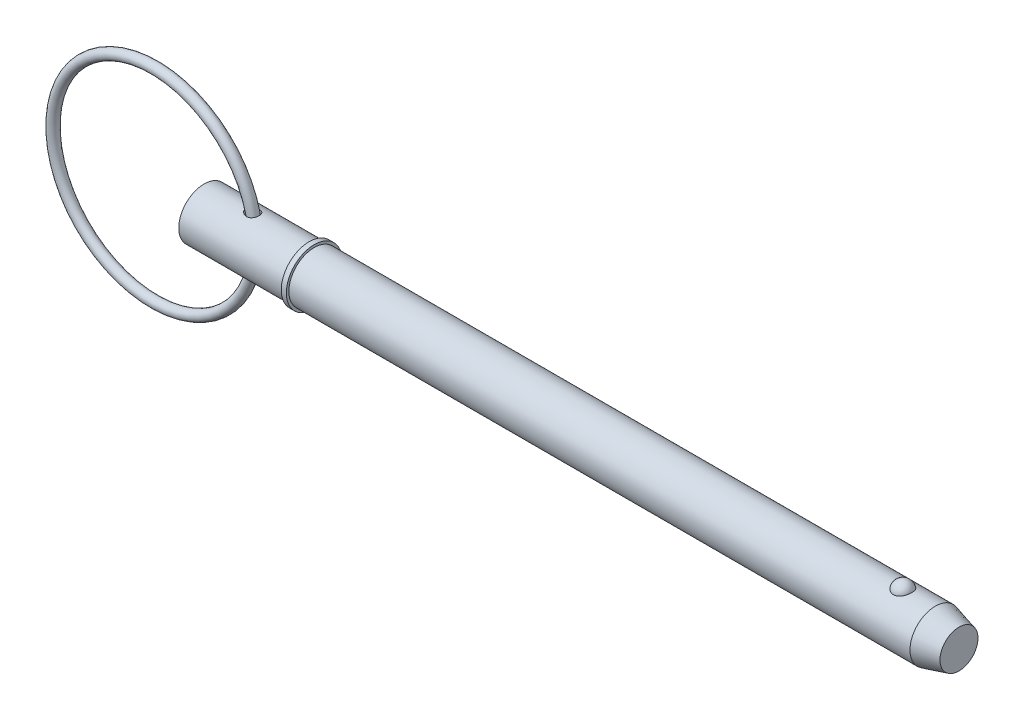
ISO-10303-21;
HEADER;
FILE_DESCRIPTION(('STEP AP214'),'2;1');
FILE_NAME('part.step','',(''),(''),'','','');
FILE_SCHEMA(('AUTOMOTIVE_DESIGN { 1 0 10303 214 1 1 1 1 }'));
ENDSEC;
DATA;
#1=APPLICATION_CONTEXT('core data for automotive mechanical design processes');
#2=APPLICATION_PROTOCOL_DEFINITION('international standard','automotive_design',2000,#1);
#3=PRODUCT_CONTEXT('',#1,'mechanical');
#4=PRODUCT('Part','Part','',(#3));
#5=PRODUCT_RELATED_PRODUCT_CATEGORY('part','',(#4));
#6=PRODUCT_DEFINITION_FORMATION('','',#4);
#7=PRODUCT_DEFINITION_CONTEXT('part definition',#1,'design');
#8=PRODUCT_DEFINITION('design','',#6,#7);
#9=PRODUCT_DEFINITION_SHAPE('','',#8);
#10=(LENGTH_UNIT() NAMED_UNIT(*) SI_UNIT(.MILLI.,.METRE.));
#11=(NAMED_UNIT(*) PLANE_ANGLE_UNIT() SI_UNIT($,.RADIAN.));
#12=(NAMED_UNIT(*) SI_UNIT($,.STERADIAN.) SOLID_ANGLE_UNIT());
#13=UNCERTAINTY_MEASURE_WITH_UNIT(LENGTH_MEASURE(1.E-05),#10,'distance_accuracy_value','');
#14=(GEOMETRIC_REPRESENTATION_CONTEXT(3) GLOBAL_UNCERTAINTY_ASSIGNED_CONTEXT((#13)) GLOBAL_UNIT_ASSIGNED_CONTEXT((#10,
#11,#12)) REPRESENTATION_CONTEXT('',''));
#15=CARTESIAN_POINT('',(0.,0.,0.));
#16=DIRECTION('',(0.,0.,1.));
#17=DIRECTION('',(1.,0.,0.));
#18=AXIS2_PLACEMENT_3D('',#15,#16,#17);
#19=CARTESIAN_POINT('',(-10.8860601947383,0.,0.));
#20=DIRECTION('',(0.,0.,1.));
#21=DIRECTION('',(1.,0.,0.));
#22=AXIS2_PLACEMENT_3D('',#19,#20,#21);
#23=TOROIDAL_SURFACE('',#22,22.225,1.111);
#24=CARTESIAN_POINT('',(12.4499398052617,0.,0.));
#25=VERTEX_POINT('',#24);
#26=VERTEX_LOOP('',#25);
#27=FACE_BOUND('',#26,.T.);
#28=ADVANCED_FACE('P0_F12',(#27),#23,.T.);
#29=CLOSED_SHELL('',(#28));
#30=MANIFOLD_SOLID_BREP('P0_B1',#29);
#31=CARTESIAN_POINT('',(0.,0.,0.));
#32=DIRECTION('',(1.,0.,0.));
#33=DIRECTION('',(0.,0.,-1.));
#34=AXIS2_PLACEMENT_3D('',#31,#32,#33);
#35=CYLINDRICAL_SURFACE('',#34,5.555);
#36=CARTESIAN_POINT('',(9.73108588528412,5.4531967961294,-1.05861687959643));
#37=CARTESIAN_POINT('',(9.79852417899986,5.4428857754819,-1.11173367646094));
#38=CARTESIAN_POINT('',(9.8705426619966,5.43287373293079,-1.15917228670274));
#39=CARTESIAN_POINT('',(10.0216706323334,5.41463354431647,-1.24159548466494));
#40=CARTESIAN_POINT('',(10.100788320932,5.40640749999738,-1.27656543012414));
#41=CARTESIAN_POINT('',(10.2640671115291,5.39277501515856,-1.33298568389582));
#42=CARTESIAN_POINT('',(10.3482338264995,5.38737178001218,-1.35442062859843));
#43=CARTESIAN_POINT('',(10.5191189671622,5.38018930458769,-1.38268153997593));
#44=CARTESIAN_POINT('',(10.6058357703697,5.37840780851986,-1.38951660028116));
#45=CARTESIAN_POINT('',(10.7759121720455,5.37883071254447,-1.38787777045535));
#46=CARTESIAN_POINT('',(10.8592768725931,5.38088957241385,-1.37996287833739));
#47=CARTESIAN_POINT('',(11.0231742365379,5.38856355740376,-1.34968531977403));
#48=CARTESIAN_POINT('',(11.1037078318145,5.39417750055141,-1.3273274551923));
#49=CARTESIAN_POINT('',(11.2542656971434,5.40784427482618,-1.27044672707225));
#50=CARTESIAN_POINT('',(11.3246325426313,5.41571997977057,-1.23678468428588));
#51=CARTESIAN_POINT('',(11.4584043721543,5.43310849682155,-1.15800564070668));
#52=CARTESIAN_POINT('',(11.5218100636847,5.44262114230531,-1.11288980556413));
#53=CARTESIAN_POINT('',(11.6387006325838,5.4619946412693,-1.01348173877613));
#54=CARTESIAN_POINT('',(11.6923567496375,5.47184490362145,-0.959388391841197));
#55=CARTESIAN_POINT('',(11.7899079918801,5.49098914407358,-0.842935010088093));
#56=CARTESIAN_POINT('',(11.8338027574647,5.5002831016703,-0.780574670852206));
#57=CARTESIAN_POINT('',(11.9111930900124,5.51740919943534,-0.648605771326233));
#58=CARTESIAN_POINT('',(11.944571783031,5.52522454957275,-0.578926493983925));
#59=CARTESIAN_POINT('',(11.9994972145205,5.5384271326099,-0.434834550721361));
#60=CARTESIAN_POINT('',(12.0210434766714,5.54381426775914,-0.360421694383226));
#61=CARTESIAN_POINT('',(12.0519313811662,5.55161917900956,-0.208311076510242));
#62=CARTESIAN_POINT('',(12.0611710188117,5.55401212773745,-0.130591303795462));
#63=CARTESIAN_POINT('',(12.0668974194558,5.55548938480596,0.025348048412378));
#64=CARTESIAN_POINT('',(12.0633840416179,5.55457365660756,0.103567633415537));
#65=CARTESIAN_POINT('',(12.0436796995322,5.54953010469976,0.258343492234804));
#66=CARTESIAN_POINT('',(12.0274798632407,5.54540003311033,0.334898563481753));
#67=CARTESIAN_POINT('',(11.9827711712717,5.53437033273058,0.484118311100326));
#68=CARTESIAN_POINT('',(11.9542620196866,5.52747063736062,0.556782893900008));
#69=CARTESIAN_POINT('',(11.8856108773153,5.51165296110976,0.696153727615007));
#70=CARTESIAN_POINT('',(11.8454690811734,5.50273501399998,0.762860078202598));
#71=CARTESIAN_POINT('',(11.7545317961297,5.48386724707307,0.888403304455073));
#72=CARTESIAN_POINT('',(11.7037367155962,5.47391746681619,0.94724048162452));
#73=CARTESIAN_POINT('',(11.5931044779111,5.45416351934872,1.05504470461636));
#74=CARTESIAN_POINT('',(11.533318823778,5.44435885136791,1.10406448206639));
#75=CARTESIAN_POINT('',(11.4061321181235,5.42595363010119,1.19123649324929));
#76=CARTESIAN_POINT('',(11.3387321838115,5.41735290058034,1.22939031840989));
#77=CARTESIAN_POINT('',(11.1991395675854,5.4024225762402,1.29341737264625));
#78=CARTESIAN_POINT('',(11.1270175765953,5.3960658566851,1.3194385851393));
#79=CARTESIAN_POINT('',(10.979323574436,5.38614405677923,1.35937634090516));
#80=CARTESIAN_POINT('',(10.9037515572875,5.38257898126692,1.37329286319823));
#81=CARTESIAN_POINT('',(10.7507722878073,5.37854282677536,1.38901730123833));
#82=CARTESIAN_POINT('',(10.6733560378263,5.37809300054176,1.39074204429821));
#83=CARTESIAN_POINT('',(10.5192388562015,5.38029043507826,1.38221411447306));
#84=CARTESIAN_POINT('',(10.4425381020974,5.38293844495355,1.37195854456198));
#85=CARTESIAN_POINT('',(10.2878936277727,5.39116673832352,1.33926960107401));
#86=CARTESIAN_POINT('',(10.2100819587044,5.3968880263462,1.31624874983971));
#87=CARTESIAN_POINT('',(10.0591420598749,5.4106466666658,1.25849276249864));
#88=CARTESIAN_POINT('',(9.98601576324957,5.41868496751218,1.22375282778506));
#89=CARTESIAN_POINT('',(9.84175565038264,5.43675805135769,1.14087469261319));
#90=CARTESIAN_POINT('',(9.77103801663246,5.44688674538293,1.09202994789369));
#91=CARTESIAN_POINT('',(9.63888287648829,5.46759592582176,0.983100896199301));
#92=CARTESIAN_POINT('',(9.57744762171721,5.47817652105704,0.923013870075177));
#93=CARTESIAN_POINT('',(9.4662044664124,5.49850106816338,0.792984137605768));
#94=CARTESIAN_POINT('',(9.4163677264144,5.5082470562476,0.723066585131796));
#95=CARTESIAN_POINT('',(9.33050546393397,5.52566389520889,0.574973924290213));
#96=CARTESIAN_POINT('',(9.29446727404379,5.53333664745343,0.496806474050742));
#97=CARTESIAN_POINT('',(9.24109888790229,5.54491199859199,0.342579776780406));
#98=CARTESIAN_POINT('',(9.22228936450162,5.54910883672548,0.26705568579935));
#99=CARTESIAN_POINT('',(9.19883437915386,5.55436306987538,0.113748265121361));
#100=CARTESIAN_POINT('',(9.19417820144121,5.55542284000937,0.0359666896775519));
#101=CARTESIAN_POINT('',(9.19905385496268,5.55432298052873,-0.111477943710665));
#102=CARTESIAN_POINT('',(9.20724428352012,5.55246769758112,-0.181191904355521));
#103=CARTESIAN_POINT('',(9.23493000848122,5.54630180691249,-0.318223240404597));
#104=CARTESIAN_POINT('',(9.25442702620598,5.54199082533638,-0.385540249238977));
#105=CARTESIAN_POINT('',(9.30387481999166,5.5313474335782,-0.516280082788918));
#106=CARTESIAN_POINT('',(9.33386163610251,5.52500806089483,-0.579688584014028));
#107=CARTESIAN_POINT('',(9.40305503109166,5.51092599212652,-0.701037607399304));
#108=CARTESIAN_POINT('',(9.44225922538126,5.50318365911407,-0.758979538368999));
#109=CARTESIAN_POINT('',(9.52133732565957,5.48833949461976,-0.859230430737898));
#110=CARTESIAN_POINT('',(9.55998996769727,5.48134889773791,-0.902529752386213));
#111=CARTESIAN_POINT('',(9.64209346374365,5.46725903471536,-0.984288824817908));
#112=CARTESIAN_POINT('',(9.68554534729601,5.46015974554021,-1.02274753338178));
#113=CARTESIAN_POINT('',(9.73108588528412,5.4531967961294,-1.05861687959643));
#114=B_SPLINE_CURVE_WITH_KNOTS('',3,(#36,#37,#38,#39,#40,#41,#42,#43,#44,#45,#46,#47,#48,#49,
#50,#51,#52,#53,#54,#55,#56,#57,#58,#59,#60,#61,#62,#63,#64,#65,#66,#67,#68,#69,#70,#71,#72,#73,
#74,#75,#76,#77,#78,#79,#80,#81,#82,#83,#84,#85,#86,#87,#88,#89,#90,#91,#92,#93,#94,#95,#96,#97,
#98,#99,#100,#101,#102,#103,#104,#105,#106,#107,#108,#109,#110,#111,#112,#113),.UNSPECIFIED.,
.T.,.F.,(4,2,2,2,2,2,2,2,2,2,2,2,2,2,2,2,2,2,2,2,2,2,2,2,2,2,2,2,2,2,2,2,2,2,2,2,2,2,4),(0.,
0.259176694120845,0.518656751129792,0.778430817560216,1.03804303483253,1.28801585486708,
1.53790560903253,1.77195750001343,2.00598558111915,2.23539047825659,2.4648038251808,
2.69668356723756,2.9285726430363,3.16237203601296,3.39617401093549,3.63013963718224,
3.86411088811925,4.09807822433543,4.33203659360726,4.56470246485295,4.79733424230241,
5.02704913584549,5.25676442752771,5.48804534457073,5.71938220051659,5.96237360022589,
6.20546461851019,6.46387943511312,6.72235683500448,6.98018450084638,7.23777490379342,
7.4702968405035,7.70264268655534,7.91229396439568,8.12197716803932,8.33238797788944,
8.54274441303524,8.71772674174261,8.89274668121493),.UNSPECIFIED.);
#115=CARTESIAN_POINT('',(9.73108588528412,5.4531967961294,-1.05861687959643));
#116=VERTEX_POINT('',#115);
#117=EDGE_CURVE('P1_E42',#116,#116,#114,.T.);
#118=ORIENTED_EDGE('',*,*,#117,.T.);
#119=EDGE_LOOP('',(#118));
#120=FACE_BOUND('',#119,.T.);
#121=CARTESIAN_POINT('',(0.,0.,0.));
#122=DIRECTION('',(1.,0.,0.));
#123=DIRECTION('',(0.,0.,-1.));
#124=AXIS2_PLACEMENT_3D('',#121,#122,#123);
#125=CIRCLE('',#124,5.555);
#126=CARTESIAN_POINT('',(0.,0.,-5.555));
#127=VERTEX_POINT('',#126);
#128=EDGE_CURVE('P1_E9',#127,#127,#125,.T.);
#129=ORIENTED_EDGE('',*,*,#128,.T.);
#130=EDGE_LOOP('',(#129));
#131=FACE_BOUND('',#130,.T.);
#132=CARTESIAN_POINT('',(23.019,0.,0.));
#133=DIRECTION('',(1.,0.,0.));
#134=DIRECTION('',(0.,0.,-1.));
#135=AXIS2_PLACEMENT_3D('',#132,#133,#134);
#136=CIRCLE('',#135,5.555);
#137=CARTESIAN_POINT('',(23.019,0.,-5.555));
#138=VERTEX_POINT('',#137);
#139=EDGE_CURVE('P1_E25',#138,#138,#136,.T.);
#140=ORIENTED_EDGE('',*,*,#139,.F.);
#141=EDGE_LOOP('',(#140));
#142=FACE_BOUND('',#141,.T.);
#143=CARTESIAN_POINT('',(9.73108588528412,-5.4531967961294,-1.05861687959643));
#144=CARTESIAN_POINT('',(9.66821110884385,-5.46281068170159,-1.00909184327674));
#145=CARTESIAN_POINT('',(9.60927221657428,-5.47269103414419,-0.954597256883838));
#146=CARTESIAN_POINT('',(9.50103698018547,-5.49196271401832,-0.836622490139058));
#147=CARTESIAN_POINT('',(9.45174193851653,-5.50135397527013,-0.773141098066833));
#148=CARTESIAN_POINT('',(9.36449982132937,-5.51864538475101,-0.638139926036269));
#149=CARTESIAN_POINT('',(9.32660692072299,-5.52653835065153,-0.566583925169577));
#150=CARTESIAN_POINT('',(9.26443740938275,-5.53978685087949,-0.417563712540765));
#151=CARTESIAN_POINT('',(9.24015003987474,-5.54514438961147,-0.34010422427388));
#152=CARTESIAN_POINT('',(9.20806696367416,-5.55228040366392,-0.188389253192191));
#153=CARTESIAN_POINT('',(9.19907227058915,-5.55431849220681,-0.114399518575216));
#154=CARTESIAN_POINT('',(9.19432225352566,-5.55539069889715,0.0340148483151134));
#155=CARTESIAN_POINT('',(9.19856204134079,-5.55442592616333,0.108439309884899));
#156=CARTESIAN_POINT('',(9.21926816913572,-5.54978420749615,0.250226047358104));
#157=CARTESIAN_POINT('',(9.2348766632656,-5.54629766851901,0.31772275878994));
#158=CARTESIAN_POINT('',(9.27656619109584,-5.53719805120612,0.449233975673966));
#159=CARTESIAN_POINT('',(9.3026486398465,-5.53158468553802,0.513248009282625));
#160=CARTESIAN_POINT('',(9.36540111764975,-5.51852259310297,0.63880901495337));
#161=CARTESIAN_POINT('',(9.40244578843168,-5.51101059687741,0.700161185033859));
#162=CARTESIAN_POINT('',(9.48531033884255,-5.49498546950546,0.816463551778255));
#163=CARTESIAN_POINT('',(9.5311337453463,-5.48647193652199,0.871411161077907));
#164=CARTESIAN_POINT('',(9.63549825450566,-5.46826315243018,0.979510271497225));
#165=CARTESIAN_POINT('',(9.69487291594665,-5.4585383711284,1.03185240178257));
#166=CARTESIAN_POINT('',(9.82107706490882,-5.43973797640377,1.12677509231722));
#167=CARTESIAN_POINT('',(9.8879103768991,-5.43066269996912,1.16935061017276));
#168=CARTESIAN_POINT('',(10.033391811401,-5.41336505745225,1.24708757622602));
#169=CARTESIAN_POINT('',(10.1125613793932,-5.40528106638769,1.28130933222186));
#170=CARTESIAN_POINT('',(10.2757060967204,-5.39196874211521,1.3362270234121));
#171=CARTESIAN_POINT('',(10.3596813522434,-5.38674047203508,1.35692265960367));
#172=CARTESIAN_POINT('',(10.5297702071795,-5.37991196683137,1.38375156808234));
#173=CARTESIAN_POINT('',(10.6158742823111,-5.37829778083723,1.38994084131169));
#174=CARTESIAN_POINT('',(10.7878226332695,-5.37901070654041,1.38718250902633));
#175=CARTESIAN_POINT('',(10.8736670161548,-5.38133587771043,1.37824235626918));
#176=CARTESIAN_POINT('',(11.0366214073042,-5.38945418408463,1.34612618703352));
#177=CARTESIAN_POINT('',(11.1139351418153,-5.39501006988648,1.32392147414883));
#178=CARTESIAN_POINT('',(11.2633246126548,-5.40877222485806,1.26652021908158));
#179=CARTESIAN_POINT('',(11.3354015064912,-5.41697790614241,1.23132655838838));
#180=CARTESIAN_POINT('',(11.4690899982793,-5.43466078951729,1.15069817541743));
#181=CARTESIAN_POINT('',(11.5310200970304,-5.4440673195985,1.10577441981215));
#182=CARTESIAN_POINT('',(11.6463540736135,-5.46335537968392,1.0061512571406));
#183=CARTESIAN_POINT('',(11.6997580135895,-5.47323690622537,0.951451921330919));
#184=CARTESIAN_POINT('',(11.7967319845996,-5.49239864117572,0.833747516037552));
#185=CARTESIAN_POINT('',(11.8402908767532,-5.50167816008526,0.770733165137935));
#186=CARTESIAN_POINT('',(11.9164538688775,-5.518621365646,0.638202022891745));
#187=CARTESIAN_POINT('',(11.9490573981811,-5.52628496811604,0.568684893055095));
#188=CARTESIAN_POINT('',(12.0028717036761,-5.53925911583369,0.424207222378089));
#189=CARTESIAN_POINT('',(12.023941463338,-5.54454040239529,0.349191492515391));
#190=CARTESIAN_POINT('',(12.053591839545,-5.55204602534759,0.196582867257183));
#191=CARTESIAN_POINT('',(12.0621722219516,-5.55427030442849,0.118989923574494));
#192=CARTESIAN_POINT('',(12.0666512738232,-5.55542602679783,-0.0368468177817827));
#193=CARTESIAN_POINT('',(12.0625074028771,-5.55434642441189,-0.11509192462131));
#194=CARTESIAN_POINT('',(12.0415418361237,-5.54898613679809,-0.269753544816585));
#195=CARTESIAN_POINT('',(12.0247199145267,-5.54470539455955,-0.346170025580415));
#196=CARTESIAN_POINT('',(11.9787920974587,-5.53340452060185,-0.495008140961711));
#197=CARTESIAN_POINT('',(11.9496857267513,-5.52638428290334,-0.56742962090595));
#198=CARTESIAN_POINT('',(11.8798787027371,-5.51036911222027,-0.706216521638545));
#199=CARTESIAN_POINT('',(11.8391779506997,-5.50137416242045,-0.772581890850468));
#200=CARTESIAN_POINT('',(11.7472553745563,-5.48242167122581,-0.897247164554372));
#201=CARTESIAN_POINT('',(11.6960515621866,-5.47246579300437,-0.955560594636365));
#202=CARTESIAN_POINT('',(11.5843994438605,-5.45270071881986,-1.06256643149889));
#203=CARTESIAN_POINT('',(11.5239521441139,-5.44289150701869,-1.11125988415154));
#204=CARTESIAN_POINT('',(11.396157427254,-5.42463941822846,-1.19717500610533));
#205=CARTESIAN_POINT('',(11.3288903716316,-5.41618309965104,-1.23451335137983));
#206=CARTESIAN_POINT('',(11.1888557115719,-5.40145691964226,-1.29743539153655));
#207=CARTESIAN_POINT('',(11.1160887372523,-5.39518680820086,-1.32302043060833));
#208=CARTESIAN_POINT('',(10.9677009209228,-5.38553131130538,-1.36179181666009));
#209=CARTESIAN_POINT('',(10.8921036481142,-5.38212602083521,-1.3750637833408));
#210=CARTESIAN_POINT('',(10.7396925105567,-5.37842027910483,-1.38948741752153));
#211=CARTESIAN_POINT('',(10.6628784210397,-5.37812040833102,-1.39063681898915));
#212=CARTESIAN_POINT('',(10.5077947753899,-5.38059635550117,-1.38102577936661));
#213=CARTESIAN_POINT('',(10.4295489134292,-5.3834629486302,-1.36991384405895));
#214=CARTESIAN_POINT('',(10.2758428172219,-5.3920092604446,-1.33587599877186));
#215=CARTESIAN_POINT('',(10.2003829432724,-5.39768934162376,-1.31294856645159));
#216=CARTESIAN_POINT('',(10.0559381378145,-5.4110281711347,-1.25682313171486));
#217=CARTESIAN_POINT('',(9.98683368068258,-5.41862962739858,-1.22391777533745));
#218=CARTESIAN_POINT('',(9.85432617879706,-5.43513913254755,-1.14838146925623));
#219=CARTESIAN_POINT('',(9.79092361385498,-5.44404729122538,-1.1057497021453));
#220=CARTESIAN_POINT('',(9.73108588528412,-5.4531967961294,-1.05861687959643));
#221=B_SPLINE_CURVE_WITH_KNOTS('',3,(#143,#144,#145,#146,#147,#148,#149,#150,#151,#152,#153,
#154,#155,#156,#157,#158,#159,#160,#161,#162,#163,#164,#165,#166,#167,#168,#169,#170,#171,#172,
#173,#174,#175,#176,#177,#178,#179,#180,#181,#182,#183,#184,#185,#186,#187,#188,#189,#190,#191,
#192,#193,#194,#195,#196,#197,#198,#199,#200,#201,#202,#203,#204,#205,#206,#207,#208,#209,#210,
#211,#212,#213,#214,#215,#216,#217,#218,#219,#220),.UNSPECIFIED.,.T.,.F.,(4,2,2,2,2,2,2,2,2,2,2,
2,2,2,2,2,2,2,2,2,2,2,2,2,2,2,2,2,2,2,2,2,2,2,2,2,2,2,4),(0.,0.241596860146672,
0.483226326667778,0.725986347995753,0.968554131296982,1.19103755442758,1.41343881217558,
1.62059806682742,1.82778531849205,2.04308674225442,2.25847484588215,2.4967195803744,
2.73508704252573,2.99374644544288,3.25241156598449,3.51007646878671,3.76761448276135,
4.00827541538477,4.24888299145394,4.47904430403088,4.70920393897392,4.93962269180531,
5.17005344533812,5.4032419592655,5.63643484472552,5.87040820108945,6.10438572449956,
6.33837230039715,6.57236086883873,6.80595147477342,7.03951667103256,7.27059385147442,
7.50164459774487,7.73107640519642,7.96055109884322,8.19677907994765,8.43303750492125,
8.66294515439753,8.89287213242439),.UNSPECIFIED.);
#222=CARTESIAN_POINT('',(9.73108588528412,-5.4531967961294,-1.05861687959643));
#223=VERTEX_POINT('',#222);
#224=EDGE_CURVE('P1_E17',#223,#223,#221,.T.);
#225=ORIENTED_EDGE('',*,*,#224,.T.);
#226=EDGE_LOOP('',(#225));
#227=FACE_BOUND('',#226,.T.);
#228=ADVANCED_FACE('P1_F13',(#120,#131,#142,#227),#35,.T.);
#229=CARTESIAN_POINT('',(0.,0.,0.));
#230=DIRECTION('',(1.,0.,0.));
#231=DIRECTION('',(0.,0.,-1.));
#232=AXIS2_PLACEMENT_3D('',#229,#230,#231);
#233=CYLINDRICAL_SURFACE('',#232,5.555);
#234=CARTESIAN_POINT('',(160.217114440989,0.,0.));
#235=DIRECTION('',(1.,0.,0.));
#236=DIRECTION('',(0.,0.,-1.));
#237=AXIS2_PLACEMENT_3D('',#234,#235,#236);
#238=CIRCLE('',#237,5.555);
#239=CARTESIAN_POINT('',(160.217114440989,0.,-5.555));
#240=VERTEX_POINT('',#239);
#241=EDGE_CURVE('P1_E99',#240,#240,#238,.T.);
#242=ORIENTED_EDGE('',*,*,#241,.F.);
#243=EDGE_LOOP('',(#242));
#244=FACE_BOUND('',#243,.T.);
#245=CARTESIAN_POINT('',(24.13,0.,0.));
#246=DIRECTION('',(1.,0.,0.));
#247=DIRECTION('',(0.,0.,-1.));
#248=AXIS2_PLACEMENT_3D('',#245,#246,#247);
#249=CIRCLE('',#248,5.555);
#250=CARTESIAN_POINT('',(24.13,0.,-5.555));
#251=VERTEX_POINT('',#250);
#252=EDGE_CURVE('P1_E96',#251,#251,#249,.T.);
#253=ORIENTED_EDGE('',*,*,#252,.T.);
#254=EDGE_LOOP('',(#253));
#255=FACE_BOUND('',#254,.T.);
#256=CARTESIAN_POINT('',(153.098626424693,5.16741224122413,2.03859650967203));
#257=CARTESIAN_POINT('',(152.992949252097,5.16740893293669,2.03859990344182));
#258=CARTESIAN_POINT('',(152.88729894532,5.17079470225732,2.03008306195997));
#259=CARTESIAN_POINT('',(152.679141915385,5.18392795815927,1.99630721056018));
#260=CARTESIAN_POINT('',(152.576634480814,5.19367399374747,1.97105201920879));
#261=CARTESIAN_POINT('',(152.377771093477,5.21839168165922,1.90463997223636));
#262=CARTESIAN_POINT('',(152.281406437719,5.23335573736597,1.86350622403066));
#263=CARTESIAN_POINT('',(152.097080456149,5.26688076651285,1.76652592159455));
#264=CARTESIAN_POINT('',(152.009120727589,5.28544242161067,1.7106765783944));
#265=CARTESIAN_POINT('',(151.841265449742,5.32479845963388,1.58399959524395));
#266=CARTESIAN_POINT('',(151.76166564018,5.34564089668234,1.51279545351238));
#267=CARTESIAN_POINT('',(151.61512901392,5.38697258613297,1.35828584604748));
#268=CARTESIAN_POINT('',(151.548194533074,5.40746177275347,1.27497815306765));
#269=CARTESIAN_POINT('',(151.42561039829,5.44694508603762,1.09440293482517));
#270=CARTESIAN_POINT('',(151.370598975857,5.46583143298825,0.996677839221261));
#271=CARTESIAN_POINT('',(151.276937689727,5.49908030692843,0.792961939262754));
#272=CARTESIAN_POINT('',(151.238289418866,5.513442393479,0.68697033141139));
#273=CARTESIAN_POINT('',(151.177680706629,5.536358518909,0.468019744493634));
#274=CARTESIAN_POINT('',(151.155972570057,5.54482455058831,0.354981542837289));
#275=CARTESIAN_POINT('',(151.130636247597,5.55473324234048,0.126595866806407));
#276=CARTESIAN_POINT('',(151.127007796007,5.55617600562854,0.0112484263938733));
#277=CARTESIAN_POINT('',(151.137881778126,5.55189984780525,-0.218011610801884));
#278=CARTESIAN_POINT('',(151.152315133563,5.54620821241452,-0.331928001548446));
#279=CARTESIAN_POINT('',(151.198903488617,5.52828920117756,-0.555544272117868));
#280=CARTESIAN_POINT('',(151.231058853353,5.5160616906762,-0.665244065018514));
#281=CARTESIAN_POINT('',(151.312488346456,5.48630779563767,-0.877469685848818));
#282=CARTESIAN_POINT('',(151.361781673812,5.4687754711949,-0.979987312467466));
#283=CARTESIAN_POINT('',(151.476478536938,5.43024700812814,-1.17486975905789));
#284=CARTESIAN_POINT('',(151.541883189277,5.4092506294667,-1.26723387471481));
#285=CARTESIAN_POINT('',(151.687571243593,5.36600927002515,-1.43940133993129));
#286=CARTESIAN_POINT('',(151.767885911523,5.34376173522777,-1.5191776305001));
#287=CARTESIAN_POINT('',(151.941452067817,5.30057971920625,-1.66360338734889));
#288=CARTESIAN_POINT('',(152.034702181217,5.27964509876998,-1.72825445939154));
#289=CARTESIAN_POINT('',(152.229393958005,5.24205250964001,-1.83909478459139));
#290=CARTESIAN_POINT('',(152.330590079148,5.22530519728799,-1.88568407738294));
#291=CARTESIAN_POINT('',(152.540155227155,5.19750919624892,-1.96100802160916));
#292=CARTESIAN_POINT('',(152.648521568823,5.18645838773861,-1.98974931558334));
#293=CARTESIAN_POINT('',(152.863498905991,5.17184410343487,-2.02742262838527));
#294=CARTESIAN_POINT('',(152.969925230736,5.16793282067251,-2.03727608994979));
#295=CARTESIAN_POINT('',(153.182992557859,5.1669899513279,-2.03966777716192));
#296=CARTESIAN_POINT('',(153.289633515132,5.16995704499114,-2.03220932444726));
#297=CARTESIAN_POINT('',(153.496773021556,5.18222383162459,-2.00071170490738));
#298=CARTESIAN_POINT('',(153.597359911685,5.19133213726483,-1.97717337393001));
#299=CARTESIAN_POINT('',(153.793014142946,5.21467637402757,-1.91475248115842));
#300=CARTESIAN_POINT('',(153.888081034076,5.22891272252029,-1.87586867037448));
#301=CARTESIAN_POINT('',(154.072371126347,5.26137066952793,-1.78282713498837));
#302=CARTESIAN_POINT('',(154.161419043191,5.27967329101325,-1.7283512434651));
#303=CARTESIAN_POINT('',(154.329288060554,5.31817411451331,-1.60597483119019));
#304=CARTESIAN_POINT('',(154.408106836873,5.33837274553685,-1.53807126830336));
#305=CARTESIAN_POINT('',(154.557515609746,5.37968287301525,-1.38688970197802));
#306=CARTESIAN_POINT('',(154.627505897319,5.40079011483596,-1.30301744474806));
#307=CARTESIAN_POINT('',(154.753012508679,5.44074401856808,-1.1245817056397));
#308=CARTESIAN_POINT('',(154.808526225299,5.4595902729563,-1.03001630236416));
#309=CARTESIAN_POINT('',(154.905550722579,5.49369849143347,-0.829439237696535));
#310=CARTESIAN_POINT('',(154.946548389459,5.50882422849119,-0.723155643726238));
#311=CARTESIAN_POINT('',(155.011125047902,5.53310911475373,-0.504772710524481));
#312=CARTESIAN_POINT('',(155.034703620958,5.54226812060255,-0.392673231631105));
#313=CARTESIAN_POINT('',(155.064013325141,5.55370358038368,-0.165459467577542));
#314=CARTESIAN_POINT('',(155.069688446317,5.55595843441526,-0.0503368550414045));
#315=CARTESIAN_POINT('',(155.062916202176,5.55329317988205,0.179288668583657));
#316=CARTESIAN_POINT('',(155.050469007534,5.54837313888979,0.293791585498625));
#317=CARTESIAN_POINT('',(155.007779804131,5.53189037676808,0.518526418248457));
#318=CARTESIAN_POINT('',(154.977598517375,5.5203503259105,0.628771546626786));
#319=CARTESIAN_POINT('',(154.900096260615,5.49182453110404,0.842318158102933));
#320=CARTESIAN_POINT('',(154.852774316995,5.47483847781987,0.945619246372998));
#321=CARTESIAN_POINT('',(154.741720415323,5.43710633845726,1.14281571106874));
#322=CARTESIAN_POINT('',(154.677921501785,5.41634501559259,1.23667048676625));
#323=CARTESIAN_POINT('',(154.535357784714,5.37334572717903,1.4118524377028));
#324=CARTESIAN_POINT('',(154.45659323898,5.35110778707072,1.49317982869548));
#325=CARTESIAN_POINT('',(154.286423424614,5.30779474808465,1.64049162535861));
#326=CARTESIAN_POINT('',(154.19510026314,5.2867132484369,1.70656877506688));
#327=CARTESIAN_POINT('',(154.001739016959,5.2480485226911,1.82201372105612));
#328=CARTESIAN_POINT('',(153.899700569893,5.23046541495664,1.87138095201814));
#329=CARTESIAN_POINT('',(153.683618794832,5.20042692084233,1.95335298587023));
#330=CARTESIAN_POINT('',(153.569260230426,5.1882019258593,1.98521734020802));
#331=CARTESIAN_POINT('',(153.336130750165,5.17169804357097,2.02783294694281));
#332=CARTESIAN_POINT('',(153.217361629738,5.16741595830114,2.03859269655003));
#333=CARTESIAN_POINT('',(153.098626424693,5.16741224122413,2.03859650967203));
#334=B_SPLINE_CURVE_WITH_KNOTS('',3,(#256,#257,#258,#259,#260,#261,#262,#263,#264,#265,#266,
#267,#268,#269,#270,#271,#272,#273,#274,#275,#276,#277,#278,#279,#280,#281,#282,#283,#284,#285,
#286,#287,#288,#289,#290,#291,#292,#293,#294,#295,#296,#297,#298,#299,#300,#301,#302,#303,#304,
#305,#306,#307,#308,#309,#310,#311,#312,#313,#314,#315,#316,#317,#318,#319,#320,#321,#322,#323,
#324,#325,#326,#327,#328,#329,#330,#331,#332,#333),.UNSPECIFIED.,.T.,.F.,(4,2,2,2,2,2,2,2,2,2,2,
2,2,2,2,2,2,2,2,2,2,2,2,2,2,2,2,2,2,2,2,2,2,2,2,2,2,2,4),(0.,0.316595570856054,
0.633118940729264,0.949183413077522,1.26530783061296,1.59030762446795,1.91536729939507,
2.25495824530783,2.59458224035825,2.93917283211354,3.2837583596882,3.62703002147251,
3.970308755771,4.31397329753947,4.65766166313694,5.00207904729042,5.34645984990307,
5.68270547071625,6.01882587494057,6.33808403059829,6.65728093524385,6.96696376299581,
7.27667180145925,7.59321535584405,7.90983070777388,8.24210387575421,8.57443684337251,
8.91755896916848,9.26068933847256,9.6048921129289,9.94909164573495,10.2921194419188,
10.6351667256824,10.9796305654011,11.324088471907,11.6663928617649,12.0087088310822,
12.3645679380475,12.7202837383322),.UNSPECIFIED.);
#335=CARTESIAN_POINT('',(153.098626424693,5.16741224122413,2.03859650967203));
#336=VERTEX_POINT('',#335);
#337=EDGE_CURVE('P1_E34',#336,#336,#334,.T.);
#338=ORIENTED_EDGE('',*,*,#337,.T.);
#339=EDGE_LOOP('',(#338));
#340=FACE_BOUND('',#339,.T.);
#341=ADVANCED_FACE('P1_F46',(#244,#255,#340),#233,.T.);
#342=CARTESIAN_POINT('',(0.,0.,0.));
#343=DIRECTION('',(-1.,0.,0.));
#344=DIRECTION('',(0.,0.,1.));
#345=AXIS2_PLACEMENT_3D('',#342,#343,#344);
#346=PLANE('',#345);
#347=ORIENTED_EDGE('',*,*,#128,.F.);
#348=EDGE_LOOP('',(#347));
#349=FACE_BOUND('',#348,.T.);
#350=ADVANCED_FACE('P1_F15',(#349),#346,.T.);
#351=CARTESIAN_POINT('',(23.019,5.555,0.));
#352=DIRECTION('',(-1.,0.,0.));
#353=DIRECTION('',(0.,0.,1.));
#354=AXIS2_PLACEMENT_3D('',#351,#352,#353);
#355=PLANE('',#354);
#356=ORIENTED_EDGE('',*,*,#139,.T.);
#357=EDGE_LOOP('',(#356));
#358=FACE_BOUND('',#357,.T.);
#359=CARTESIAN_POINT('',(23.019,0.,0.));
#360=DIRECTION('',(1.,0.,0.));
#361=DIRECTION('',(0.,0.,-1.));
#362=AXIS2_PLACEMENT_3D('',#359,#360,#361);
#363=CIRCLE('',#362,6.1105);
#364=CARTESIAN_POINT('',(23.019,0.,-6.1105));
#365=VERTEX_POINT('',#364);
#366=EDGE_CURVE('P1_E30',#365,#365,#363,.T.);
#367=ORIENTED_EDGE('',*,*,#366,.F.);
#368=EDGE_LOOP('',(#367));
#369=FACE_BOUND('',#368,.T.);
#370=ADVANCED_FACE('P1_F81',(#358,#369),#355,.T.);
#371=CARTESIAN_POINT('',(0.,0.,0.));
#372=DIRECTION('',(1.,0.,0.));
#373=DIRECTION('',(0.,0.,-1.));
#374=AXIS2_PLACEMENT_3D('',#371,#372,#373);
#375=CYLINDRICAL_SURFACE('',#374,6.1105);
#376=ORIENTED_EDGE('',*,*,#366,.T.);
#377=EDGE_LOOP('',(#376));
#378=FACE_BOUND('',#377,.T.);
#379=CARTESIAN_POINT('',(24.13,0.,0.));
#380=DIRECTION('',(1.,0.,0.));
#381=DIRECTION('',(0.,0.,-1.));
#382=AXIS2_PLACEMENT_3D('',#379,#380,#381);
#383=CIRCLE('',#382,6.1105);
#384=CARTESIAN_POINT('',(24.13,0.,-6.1105));
#385=VERTEX_POINT('',#384);
#386=EDGE_CURVE('P1_E95',#385,#385,#383,.T.);
#387=ORIENTED_EDGE('',*,*,#386,.F.);
#388=EDGE_LOOP('',(#387));
#389=FACE_BOUND('',#388,.T.);
#390=ADVANCED_FACE('P1_F68',(#378,#389),#375,.T.);
#391=CARTESIAN_POINT('',(24.13,6.1105,0.));
#392=DIRECTION('',(1.,0.,0.));
#393=DIRECTION('',(0.,0.,-1.));
#394=AXIS2_PLACEMENT_3D('',#391,#392,#393);
#395=PLANE('',#394);
#396=ORIENTED_EDGE('',*,*,#386,.T.);
#397=EDGE_LOOP('',(#396));
#398=FACE_BOUND('',#397,.T.);
#399=ORIENTED_EDGE('',*,*,#252,.F.);
#400=EDGE_LOOP('',(#399));
#401=FACE_BOUND('',#400,.T.);
#402=ADVANCED_FACE('P1_F62',(#398,#401),#395,.T.);
#403=CARTESIAN_POINT('',(165.4,0.,0.));
#404=DIRECTION('',(-1.,0.,0.));
#405=DIRECTION('',(0.,0.,1.));
#406=AXIS2_PLACEMENT_3D('',#403,#404,#405);
#407=CONICAL_SURFACE('',#406,4.16625000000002,0.26179938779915);
#408=ORIENTED_EDGE('',*,*,#241,.T.);
#409=EDGE_LOOP('',(#408));
#410=FACE_BOUND('',#409,.T.);
#411=CARTESIAN_POINT('',(165.4,0.,0.));
#412=DIRECTION('',(1.,0.,0.));
#413=DIRECTION('',(0.,0.,-1.));
#414=AXIS2_PLACEMENT_3D('',#411,#412,#413);
#415=CIRCLE('',#414,4.16625000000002);
#416=CARTESIAN_POINT('',(165.4,0.,-4.16625000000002));
#417=VERTEX_POINT('',#416);
#418=EDGE_CURVE('P1_E41',#417,#417,#415,.T.);
#419=ORIENTED_EDGE('',*,*,#418,.F.);
#420=EDGE_LOOP('',(#419));
#421=FACE_BOUND('',#420,.T.);
#422=ADVANCED_FACE('P1_F59',(#410,#421),#407,.T.);
#423=CARTESIAN_POINT('',(165.4,4.16625000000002,0.));
#424=DIRECTION('',(1.,0.,0.));
#425=DIRECTION('',(0.,0.,-1.));
#426=AXIS2_PLACEMENT_3D('',#423,#424,#425);
#427=PLANE('',#426);
#428=ORIENTED_EDGE('',*,*,#418,.T.);
#429=EDGE_LOOP('',(#428));
#430=FACE_BOUND('',#429,.T.);
#431=ADVANCED_FACE('P1_F55',(#430),#427,.T.);
#432=CARTESIAN_POINT('',(153.098626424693,4.99949999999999,0.));
#433=DIRECTION('',(-1.,0.,0.));
#434=DIRECTION('',(0.,1.,0.));
#435=AXIS2_PLACEMENT_3D('',#432,#433,#434);
#436=SPHERICAL_SURFACE('',#435,2.04549999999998);
#437=ORIENTED_EDGE('',*,*,#337,.F.);
#438=EDGE_LOOP('',(#437));
#439=FACE_BOUND('',#438,.T.);
#440=ADVANCED_FACE('P1_F50',(#439),#436,.T.);
#441=CARTESIAN_POINT('',(-10.8860601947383,0.,0.));
#442=DIRECTION('',(0.,0.,1.));
#443=DIRECTION('',(1.,0.,0.));
#444=AXIS2_PLACEMENT_3D('',#441,#442,#443);
#445=TOROIDAL_SURFACE('',#444,22.225,1.38875);
#446=ORIENTED_EDGE('',*,*,#224,.F.);
#447=EDGE_LOOP('',(#446));
#448=FACE_BOUND('',#447,.T.);
#449=ORIENTED_EDGE('',*,*,#117,.F.);
#450=EDGE_LOOP('',(#449));
#451=FACE_BOUND('',#450,.T.);
#452=ADVANCED_FACE('P1_F54',(#448,#451),#445,.F.);
#453=CLOSED_SHELL('',(#228,#341,#350,#370,#390,#402,#422,#431,#440,#452));
#454=MANIFOLD_SOLID_BREP('P1_B1',#453);
#455=ADVANCED_BREP_SHAPE_REPRESENTATION('',(#18,#30,#454),#14);
#456=SHAPE_DEFINITION_REPRESENTATION(#9,#455);
ENDSEC;
END-ISO-10303-21;
